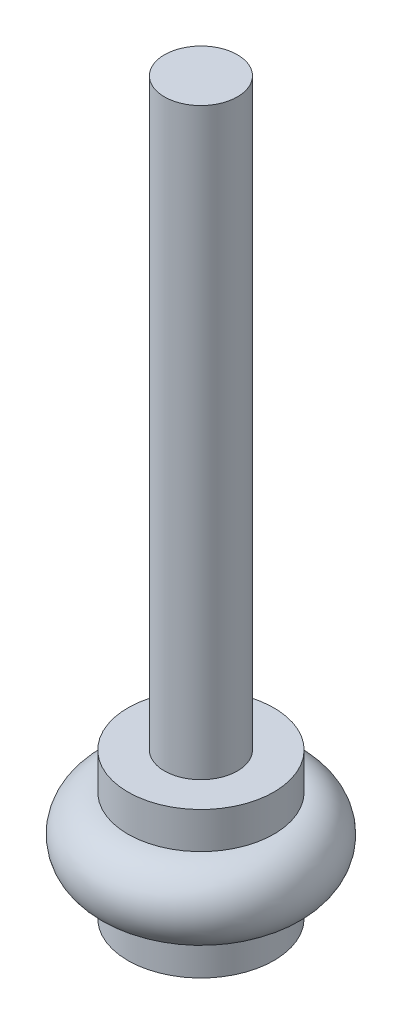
ISO-10303-21;
HEADER;
FILE_DESCRIPTION(('STEP AP214'),'2;1');
FILE_NAME('part.step','',(''),(''),'','','');
FILE_SCHEMA(('AUTOMOTIVE_DESIGN { 1 0 10303 214 1 1 1 1 }'));
ENDSEC;
DATA;
#1=APPLICATION_CONTEXT('core data for automotive mechanical design processes');
#2=APPLICATION_PROTOCOL_DEFINITION('international standard','automotive_design',2000,#1);
#3=PRODUCT_CONTEXT('',#1,'mechanical');
#4=PRODUCT('Part','Part','',(#3));
#5=PRODUCT_RELATED_PRODUCT_CATEGORY('part','',(#4));
#6=PRODUCT_DEFINITION_FORMATION('','',#4);
#7=PRODUCT_DEFINITION_CONTEXT('part definition',#1,'design');
#8=PRODUCT_DEFINITION('design','',#6,#7);
#9=PRODUCT_DEFINITION_SHAPE('','',#8);
#10=(LENGTH_UNIT() NAMED_UNIT(*) SI_UNIT(.MILLI.,.METRE.));
#11=(NAMED_UNIT(*) PLANE_ANGLE_UNIT() SI_UNIT($,.RADIAN.));
#12=(NAMED_UNIT(*) SI_UNIT($,.STERADIAN.) SOLID_ANGLE_UNIT());
#13=UNCERTAINTY_MEASURE_WITH_UNIT(LENGTH_MEASURE(1.E-05),#10,'distance_accuracy_value','');
#14=(GEOMETRIC_REPRESENTATION_CONTEXT(3) GLOBAL_UNCERTAINTY_ASSIGNED_CONTEXT((#13)) GLOBAL_UNIT_ASSIGNED_CONTEXT((#10,
#11,#12)) REPRESENTATION_CONTEXT('',''));
#15=CARTESIAN_POINT('',(0.,0.,0.));
#16=DIRECTION('',(0.,0.,1.));
#17=DIRECTION('',(1.,0.,0.));
#18=AXIS2_PLACEMENT_3D('',#15,#16,#17);
#19=CARTESIAN_POINT('',(6.35,0.,0.));
#20=DIRECTION('',(0.,1.,0.));
#21=DIRECTION('',(0.,0.,1.));
#22=AXIS2_PLACEMENT_3D('',#19,#20,#21);
#23=PLANE('',#22);
#24=CARTESIAN_POINT('',(0.,0.,0.));
#25=DIRECTION('',(0.,1.,0.));
#26=DIRECTION('',(0.,0.,1.));
#27=AXIS2_PLACEMENT_3D('',#24,#25,#26);
#28=CIRCLE('',#27,6.35);
#29=CARTESIAN_POINT('',(0.,0.,6.35));
#30=VERTEX_POINT('',#29);
#31=EDGE_CURVE('E10',#30,#30,#28,.T.);
#32=ORIENTED_EDGE('',*,*,#31,.F.);
#33=EDGE_LOOP('',(#32));
#34=FACE_BOUND('',#33,.T.);
#35=ADVANCED_FACE('F32',(#34),#23,.F.);
#36=CARTESIAN_POINT('',(0.,0.,0.));
#37=DIRECTION('',(0.,1.,0.));
#38=DIRECTION('',(0.,0.,1.));
#39=AXIS2_PLACEMENT_3D('',#36,#37,#38);
#40=CYLINDRICAL_SURFACE('',#39,6.35);
#41=CARTESIAN_POINT('',(0.,3.175,0.));
#42=DIRECTION('',(0.,1.,0.));
#43=DIRECTION('',(0.,0.,1.));
#44=AXIS2_PLACEMENT_3D('',#41,#42,#43);
#45=CIRCLE('',#44,6.35);
#46=CARTESIAN_POINT('',(0.,3.175,6.35));
#47=VERTEX_POINT('',#46);
#48=EDGE_CURVE('E38',#47,#47,#45,.T.);
#49=ORIENTED_EDGE('',*,*,#48,.F.);
#50=EDGE_LOOP('',(#49));
#51=FACE_BOUND('',#50,.T.);
#52=ORIENTED_EDGE('',*,*,#31,.T.);
#53=EDGE_LOOP('',(#52));
#54=FACE_BOUND('',#53,.T.);
#55=ADVANCED_FACE('F80',(#51,#54),#40,.T.);
#56=CARTESIAN_POINT('',(0.,6.35,0.));
#57=DIRECTION('',(0.,1.,0.));
#58=DIRECTION('',(0.,0.,1.));
#59=AXIS2_PLACEMENT_3D('',#56,#57,#58);
#60=TOROIDAL_SURFACE('',#59,6.35,3.175);
#61=CARTESIAN_POINT('',(0.,9.525,0.));
#62=DIRECTION('',(0.,1.,0.));
#63=DIRECTION('',(0.,0.,1.));
#64=AXIS2_PLACEMENT_3D('',#61,#62,#63);
#65=CIRCLE('',#64,6.35);
#66=CARTESIAN_POINT('',(0.,9.525,6.35));
#67=VERTEX_POINT('',#66);
#68=EDGE_CURVE('E42',#67,#67,#65,.T.);
#69=ORIENTED_EDGE('',*,*,#68,.F.);
#70=EDGE_LOOP('',(#69));
#71=FACE_BOUND('',#70,.T.);
#72=ORIENTED_EDGE('',*,*,#48,.T.);
#73=EDGE_LOOP('',(#72));
#74=FACE_BOUND('',#73,.T.);
#75=ADVANCED_FACE('F75',(#71,#74),#60,.T.);
#76=CARTESIAN_POINT('',(0.,0.,0.));
#77=DIRECTION('',(0.,1.,0.));
#78=DIRECTION('',(0.,0.,1.));
#79=AXIS2_PLACEMENT_3D('',#76,#77,#78);
#80=CYLINDRICAL_SURFACE('',#79,6.35);
#81=CARTESIAN_POINT('',(0.,12.7,0.));
#82=DIRECTION('',(0.,1.,0.));
#83=DIRECTION('',(0.,0.,1.));
#84=AXIS2_PLACEMENT_3D('',#81,#82,#83);
#85=CIRCLE('',#84,6.35);
#86=CARTESIAN_POINT('',(0.,12.7,6.35));
#87=VERTEX_POINT('',#86);
#88=EDGE_CURVE('E46',#87,#87,#85,.T.);
#89=ORIENTED_EDGE('',*,*,#88,.F.);
#90=EDGE_LOOP('',(#89));
#91=FACE_BOUND('',#90,.T.);
#92=ORIENTED_EDGE('',*,*,#68,.T.);
#93=EDGE_LOOP('',(#92));
#94=FACE_BOUND('',#93,.T.);
#95=ADVANCED_FACE('F69',(#91,#94),#80,.T.);
#96=CARTESIAN_POINT('',(3.17500000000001,12.7,0.));
#97=DIRECTION('',(0.,-1.,0.));
#98=DIRECTION('',(0.,0.,-1.));
#99=AXIS2_PLACEMENT_3D('',#96,#97,#98);
#100=PLANE('',#99);
#101=CARTESIAN_POINT('',(0.,12.7,0.));
#102=DIRECTION('',(0.,1.,0.));
#103=DIRECTION('',(0.,0.,1.));
#104=AXIS2_PLACEMENT_3D('',#101,#102,#103);
#105=CIRCLE('',#104,3.17500000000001);
#106=CARTESIAN_POINT('',(0.,12.7,3.17500000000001));
#107=VERTEX_POINT('',#106);
#108=EDGE_CURVE('E51',#107,#107,#105,.T.);
#109=ORIENTED_EDGE('',*,*,#108,.F.);
#110=EDGE_LOOP('',(#109));
#111=FACE_BOUND('',#110,.T.);
#112=ORIENTED_EDGE('',*,*,#88,.T.);
#113=EDGE_LOOP('',(#112));
#114=FACE_BOUND('',#113,.T.);
#115=ADVANCED_FACE('F63',(#111,#114),#100,.F.);
#116=CARTESIAN_POINT('',(0.,0.,0.));
#117=DIRECTION('',(0.,1.,0.));
#118=DIRECTION('',(0.,0.,1.));
#119=AXIS2_PLACEMENT_3D('',#116,#117,#118);
#120=CYLINDRICAL_SURFACE('',#119,3.17500000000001);
#121=CARTESIAN_POINT('',(0.,63.5,0.));
#122=DIRECTION('',(0.,1.,0.));
#123=DIRECTION('',(0.,0.,1.));
#124=AXIS2_PLACEMENT_3D('',#121,#122,#123);
#125=CIRCLE('',#124,3.175);
#126=CARTESIAN_POINT('',(0.,63.5,3.175));
#127=VERTEX_POINT('',#126);
#128=EDGE_CURVE('E54',#127,#127,#125,.T.);
#129=ORIENTED_EDGE('',*,*,#128,.F.);
#130=EDGE_LOOP('',(#129));
#131=FACE_BOUND('',#130,.T.);
#132=ORIENTED_EDGE('',*,*,#108,.T.);
#133=EDGE_LOOP('',(#132));
#134=FACE_BOUND('',#133,.T.);
#135=ADVANCED_FACE('F60',(#131,#134),#120,.T.);
#136=CARTESIAN_POINT('',(0.,63.5,0.));
#137=DIRECTION('',(0.,-1.,0.));
#138=DIRECTION('',(0.,0.,-1.));
#139=AXIS2_PLACEMENT_3D('',#136,#137,#138);
#140=PLANE('',#139);
#141=ORIENTED_EDGE('',*,*,#128,.T.);
#142=EDGE_LOOP('',(#141));
#143=FACE_BOUND('',#142,.T.);
#144=ADVANCED_FACE('F58',(#143),#140,.F.);
#145=CLOSED_SHELL('',(#35,#55,#75,#95,#115,#135,#144));
#146=MANIFOLD_SOLID_BREP('B2',#145);
#147=ADVANCED_BREP_SHAPE_REPRESENTATION('',(#18,#146),#14);
#148=SHAPE_DEFINITION_REPRESENTATION(#9,#147);
ENDSEC;
END-ISO-10303-21;
